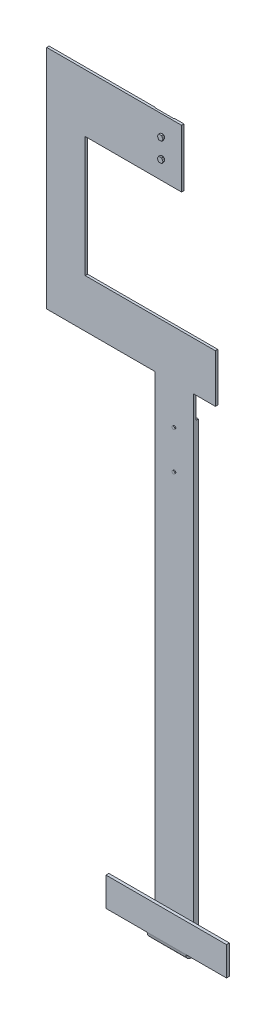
from build123d import *

# Parameters (mm, degrees)
ESTRUSIONE_ESTRUSIONE1_DEPTH       = 5
SCHIZZO2_W                         = 40
SCHIZZO2_H                         = 120
TAGLIO_ESTRUSIONE1_DEPTH           = 1
ESTRUSIONE_ESTRUSIONE2_DEPTH       = 1.5
ESTRUSIONE_ESTRUSIONE2_DEPTH_BACK  = 8
SCHIZZO3_R                         = 5
ESTRUSIONE_ESTRUSIONE3_DEPTH       = 3
ESTRUSIONE_ESTRUSIONE4_DEPTH       = 3
SCHIZZO7_W                         = 80
SCHIZZO7_H                         = 5
ESTRUSIONE_ESTRUSIONE5_DEPTH       = 800
ESTRUSIONE_ESTRUSIONE6_START       = 11
SCHIZZO8_W                         = 250
SCHIZZO8_H                         = 60
ESTRUSIONE_ESTRUSIONE6_DEPTH       = 6
SCHIZZO10_W                        = 80
SCHIZZO10_H                        = 5
RIVOLUZIONE1_ANGLE                 = 180
SCHIZZO11_W                        = 80
SCHIZZO11_H                        = 5
ESTRUSIONE_ESTRUSIONE7_DEPTH       = 2
ESTRUSIONE_ESTRUSIONE8_START       = -5
SCHIZZO12_W                        = 80
SCHIZZO12_H                        = 950
ESTRUSIONE_ESTRUSIONE8_DEPTH       = 5
SCHIZZO13_R                        = 3
TAGLIO_ESTRUSIONE2_DEPTH           = 10
ESTRUSIONE_ESTRUSIONE9_DEPTH       = 2
ESTRUSIONE_ESTRUSIONE9_DEPTH_BACK  = 13
SCHIZZO14_R                        = 3
ESTRUSIONE_ESTRUSIONE10_DEPTH      = 2
ESTRUSIONE_ESTRUSIONE10_DEPTH_BACK = 13
SCHIZZO16_R                        = 3


with BuildPart() as part:
    # Schizzo1 → Estrusione-Estrusione1 (new body)
    with BuildSketch(Plane.XY):
        Polygon((-175.379048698, 522.531518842), (24.620951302, 522.531518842), (24.620951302, 642.531518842), (-255.379048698, 642.531518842), (-255.379048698, 522.531518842), (-255.379048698, 272.531518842), (-255.379048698, 172.531518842), (-30.379048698, 172.531518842), (-30.379048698, -27.468481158), (49.620951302, -27.468481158), (49.620951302, 172.531518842), (94.620951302, 172.531518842), (94.620951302, 272.531518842), (-175.379048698, 272.531518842), align=None)
    extrude(amount=ESTRUSIONE_ESTRUSIONE1_DEPTH)

    # Schizzo2 → Taglio-Estrusione1 (cut)
    with BuildSketch(Plane(origin=(0, 0, 0), x_dir=(-1, 0, 0), z_dir=(0, 0, -1))):
        with Locations((15.379048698, 582.531518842)):
            Rectangle(SCHIZZO2_W, SCHIZZO2_H)
    extrude(amount=-TAGLIO_ESTRUSIONE1_DEPTH, mode=Mode.SUBTRACT)

    # Schizzo3 → Estrusione-Estrusione2 (add, two sides: drawn at the far end of the back side and taken through both)
    with BuildSketch(Plane.XY.offset(5).offset(-ESTRUSIONE_ESTRUSIONE2_DEPTH_BACK)):
        with Locations((-15.379048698, 562.531518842)):
            Circle(SCHIZZO3_R)
        with Locations((-15.379048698, 602.531518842)):
            Circle(SCHIZZO3_R)
    extrude(amount=ESTRUSIONE_ESTRUSIONE2_DEPTH + ESTRUSIONE_ESTRUSIONE2_DEPTH_BACK)

    # Schizzo5 → Estrusione-Estrusione3 (add)
    with BuildSketch(Plane.XY.offset(6.5)):
        Polygon((-18.379048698, 607.789240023), (-12.379048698, 607.789240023), (-9.488310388, 602.531518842), (-12.379048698, 597.273797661), (-18.379048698, 597.273797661), (-21.269787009, 602.531518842), align=None)
    extrude(amount=ESTRUSIONE_ESTRUSIONE3_DEPTH)

    # Schizzo6 → Estrusione-Estrusione4 (add)
    with BuildSketch(Plane.XY.offset(6.5)):
        Polygon((-18.379048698, 567.699968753), (-12.379048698, 567.699968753), (-9.331570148, 562.531518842), (-12.383855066, 557.365905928), (-18.383855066, 557.365905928), (-21.426527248, 562.531518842), align=None)
    extrude(amount=ESTRUSIONE_ESTRUSIONE4_DEPTH)

    # Schizzo7 → Estrusione-Estrusione5 (add)
    with BuildSketch(Plane.XZ.offset(27.468481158)):
        with Locations((9.620951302, 2.5)):
            Rectangle(SCHIZZO7_W, SCHIZZO7_H)
    extrude(amount=ESTRUSIONE_ESTRUSIONE5_DEPTH)

    # Schizzo10 → Rivoluzione1 (revolve)
    with BuildSketch(Plane.XZ.offset(827.468481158)):
        with Locations((9.620951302, 2.5)):
            Rectangle(SCHIZZO10_W, SCHIZZO10_H)
    revolve(axis=Axis((-33.442231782, -827.468481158, 10.680369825), (-1, 0, 0)), revolution_arc=RIVOLUZIONE1_ANGLE)



with BuildPart() as body_2:
    # Schizzo8 → Estrusione-Estrusione6 (new body)
    with BuildSketch(Plane.XY.offset(5).offset(ESTRUSIONE_ESTRUSIONE6_START)):
        with Locations((9.620951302, -795.917078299)):
            Rectangle(SCHIZZO8_W, SCHIZZO8_H)
    extrude(amount=ESTRUSIONE_ESTRUSIONE6_DEPTH)


with BuildPart() as part_1:
    add(part.part)

    add(body_2.part)  # Estrusione-Estrusione7 merges body 2
    # Schizzo11 → Estrusione-Estrusione7 (add)
    with BuildSketch(Plane(origin=(0, -827.468481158, 0), x_dir=(1, 0, 0), z_dir=(0, 1, 0))):
        with Locations((9.620951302, -18.86073965)):
            Rectangle(SCHIZZO11_W, SCHIZZO11_H)
    extrude(amount=ESTRUSIONE_ESTRUSIONE7_DEPTH)

    # Schizzo12 → Estrusione-Estrusione8 (add)
    with BuildSketch(Plane.XY.offset(5).offset(ESTRUSIONE_ESTRUSIONE8_START)):
        with Locations((9.620951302, -352.468481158)):
            Rectangle(SCHIZZO12_W, SCHIZZO12_H)
    extrude(amount=-ESTRUSIONE_ESTRUSIONE8_DEPTH)

    # Schizzo13 → Taglio-Estrusione2 (cut)
    with BuildSketch(Plane.XY.offset(5)):
        with Locations((9.620951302, 92.531518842)):
            Circle(SCHIZZO13_R)
        with Locations((9.620951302, 12.531518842)):
            Circle(SCHIZZO13_R)
    extrude(amount=-TAGLIO_ESTRUSIONE2_DEPTH, mode=Mode.SUBTRACT)

    # Schizzo14 → Estrusione-Estrusione9 (add, two sides: drawn at the far end of the back side and taken through both)
    with BuildSketch(Plane.XY.offset(5).offset(-ESTRUSIONE_ESTRUSIONE9_DEPTH_BACK)):
        with Locations((9.620951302, 92.531518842)):
            Circle(SCHIZZO14_R)
    extrude(amount=ESTRUSIONE_ESTRUSIONE9_DEPTH + ESTRUSIONE_ESTRUSIONE9_DEPTH_BACK)

    # Schizzo16 → Estrusione-Estrusione10 (add, two sides: drawn at the far end of the back side and taken through both)
    with BuildSketch(Plane.XY.offset(5).offset(-ESTRUSIONE_ESTRUSIONE10_DEPTH_BACK)):
        with Locations((9.620951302, 12.531518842)):
            Circle(SCHIZZO16_R)
    extrude(amount=ESTRUSIONE_ESTRUSIONE10_DEPTH + ESTRUSIONE_ESTRUSIONE10_DEPTH_BACK)


solid = part_1.part
